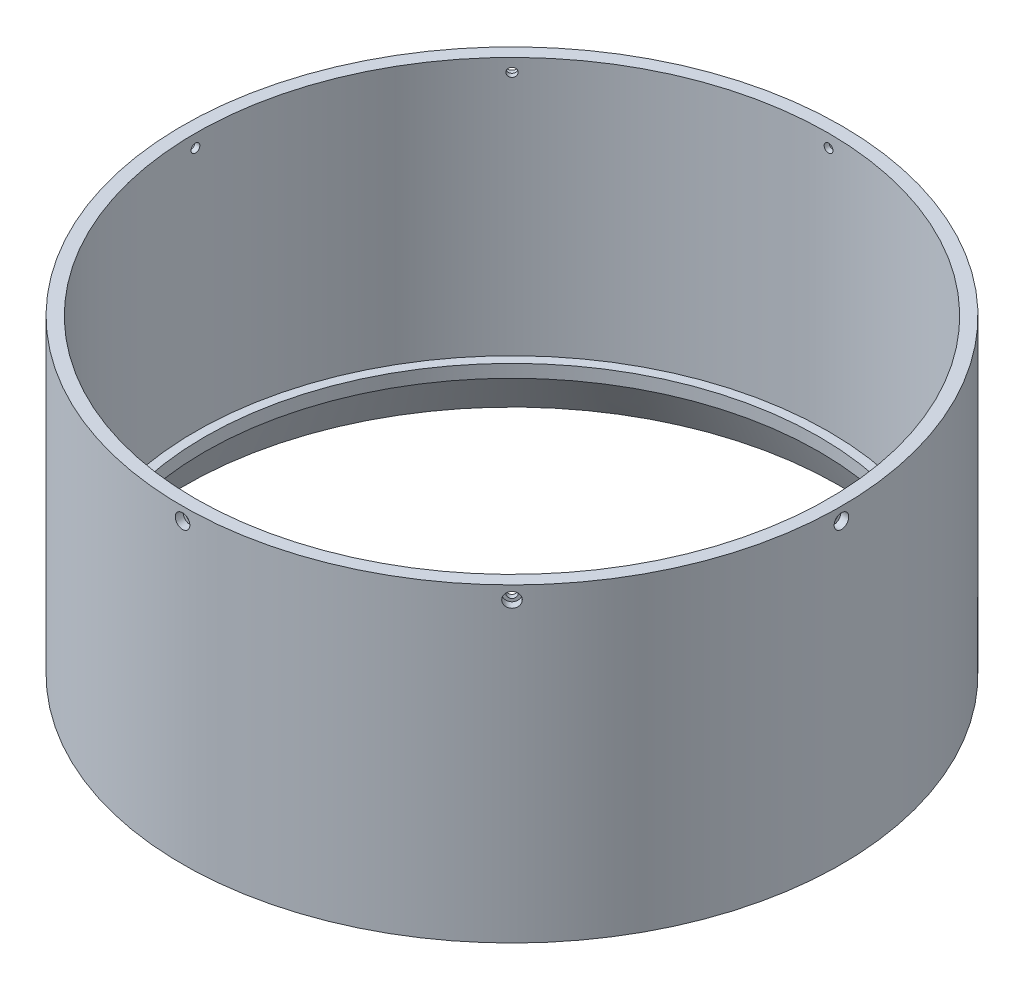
from build123d import *

# Parameters (mm, degrees)
CBORE_FOR_6_SOCKET_HEAD_CAP_SCREW1_D           = 4.3053
CBORE_FOR_6_SOCKET_HEAD_CAP_SCREW1_CBORE_D     = 7.14502
CBORE_FOR_6_SOCKET_HEAD_CAP_SCREW1_CBORE_DEPTH = 3.8862
CIRPATTERN1_COUNT                              = 8


with BuildPart() as part:
    # Sketch1 → Revolve1 (revolve)
    with BuildSketch(Plane.XY, mode=Mode.PRIVATE) as revolve1_sk:
        Polygon((-155.575, 152.4), (-155.575, 25.443311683), (-151.003, 25.443311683), (-151.003, 19.093311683), (-160.655, 0), (-161.925, 0), (-161.925, 152.4), align=None)
    revolve(revolve1_sk.sketch.rotate(Axis((0, 0, 0), (0, 1, 0)), 270), axis=Axis((0, 0, 0), (0, 1, 0)))

    # CBORE for _6 Socket Head Cap Screw1 (through all)
    with Locations(Plane(origin=(0, 0, -161.925), x_dir=(-1, 0, 0), z_dir=(0, 0, -1))):
        with Locations((0, 146.05)):
            cbore_for_6_socket_head_cap_screw1 = CounterBoreHole(CBORE_FOR_6_SOCKET_HEAD_CAP_SCREW1_D / 2, CBORE_FOR_6_SOCKET_HEAD_CAP_SCREW1_CBORE_D / 2, CBORE_FOR_6_SOCKET_HEAD_CAP_SCREW1_CBORE_DEPTH)

    # CirPattern1: CBORE for _6 Socket Head Cap Screw1 ×8 about axis
    cirpattern1_axis = Axis((0, 0, 0), (0, 1, 0))
    for i in range(1, CIRPATTERN1_COUNT):
        add(cbore_for_6_socket_head_cap_screw1.rotate(cirpattern1_axis, i * 360 / CIRPATTERN1_COUNT), mode=Mode.SUBTRACT)


solid = part.part
